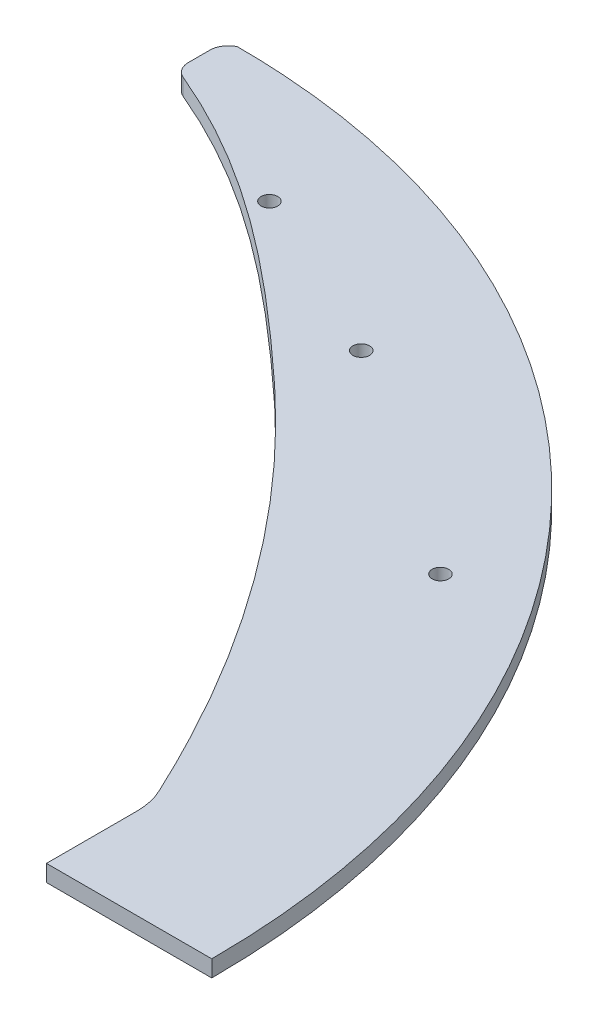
from build123d import *

# Parameters (mm, degrees)
EXTRUDE1_DEPTH = 6.35
SKETCH2_R      = 3.18135
EXTRUDE2_DEPTH = 403.835430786


with BuildPart() as part:
    # Sketch1 → Extrude1 (new body)
    with BuildSketch(Plane(origin=(0, 0, 0), x_dir=(1, 0, 0), z_dir=(0, 1, 0))):
        with BuildLine():
            Line((-50.414644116, 9.177431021), (-50.414644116, -25.403057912))
            Line((-50.414644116, -25.403057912), (-12.657224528, -25.403057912))
            Line((-12.657224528, -25.403057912), (12.750182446, -25.403057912))
            add(Edge.make_bspline(
                [(12.750182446, -25.403057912), (12.750182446, 281.299037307), (-284.39319782, 281.299037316)],
                knots=[4.71238898, 4.71238898, 4.71238898, 6.283185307, 6.283185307, 6.283185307], degree=2, weights=[1, 0.707106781, 1]))
            add(Edge.make_bspline(
                [(-284.39319782, 281.299037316), (-285.021622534, 280.770880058), (-285.64849031, 280.214344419), (-286.273725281, 279.62869292)],
                knots=[0.923259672, 0.923259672, 0.923259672, 0.923259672, 0.930191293, 0.930191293, 0.930191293, 0.930191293], degree=3))
            ThreePointArc((-286.273725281, 279.62869292), (-287.758846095, 277.519825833), (-288.282696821, 274.994259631))
            Line((-288.282696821, 274.994259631), (-288.282696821, 266.670639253))
            ThreePointArc((-288.282696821, 266.670639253), (-287.221679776, 263.15650219), (-284.393197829, 260.816714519))
            add(Edge.make_bspline(
                [(-52.797924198, 19.919432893), (-79.099570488, 76.275560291), (-119.663104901, 134.815986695), (-201.534298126, 210.049484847), (-243.729791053, 243.725214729), (-284.393197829, 260.816714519)],
                knots=[0.015452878, 0.015452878, 0.015452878, 0.015452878, 0.526895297, 0.624259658, 0.989096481, 0.989096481, 0.989096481, 0.989096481], degree=3))
            ThreePointArc((-52.797924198, 19.919432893), (-51.017621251, 14.679035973), (-50.414644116, 9.177431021))
        make_face()
    extrude(amount=EXTRUDE1_DEPTH)

    # Sketch2 → Extrude2 (cut, through all)
    with BuildSketch(Plane(origin=(0, 6.35, 0), x_dir=(1, 0, 0), z_dir=(0, 1, 0))):
        with Locations((2.42519565, 82.207872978)):
            Circle(SKETCH2_R)
        with Locations((-279.379146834, 253.126748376)):
            Circle(SKETCH2_R)
        with Locations(Location((-70.863834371, 145.578590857, 0), (0, 0, 270))):
            Circle(SKETCH2_R)
        with Locations(Location((-159.936390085, 204.386438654, 0), (0, 0, 270))):
            Circle(SKETCH2_R)
        with Locations(Location((-226.891855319, 236.255776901, 0), (0, 0, 270))):
            Circle(SKETCH2_R)
    extrude(amount=-EXTRUDE2_DEPTH, mode=Mode.SUBTRACT)


solid = part.part
